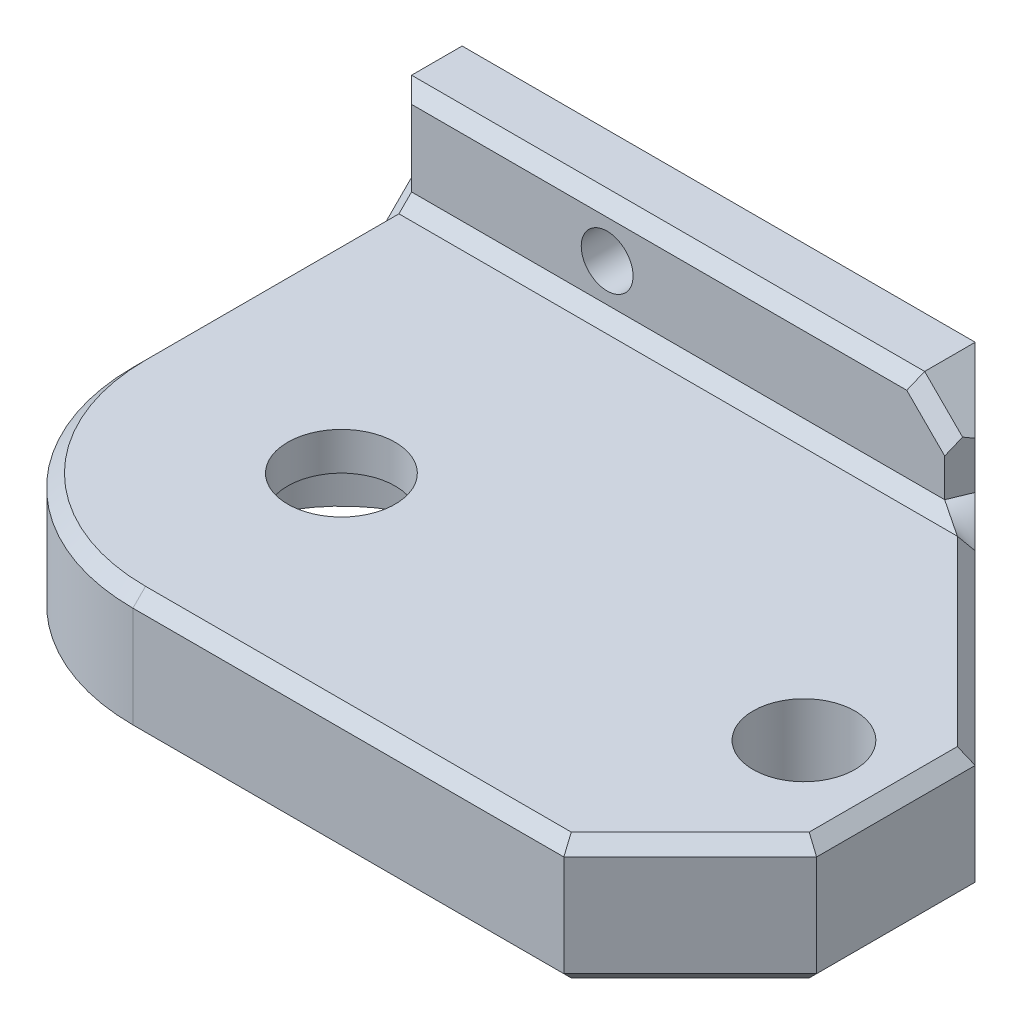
ISO-10303-21;
HEADER;
FILE_DESCRIPTION(('STEP AP214'),'2;1');
FILE_NAME('part.step','',(''),(''),'','','');
FILE_SCHEMA(('AUTOMOTIVE_DESIGN { 1 0 10303 214 1 1 1 1 }'));
ENDSEC;
DATA;
#1=APPLICATION_CONTEXT('core data for automotive mechanical design processes');
#2=APPLICATION_PROTOCOL_DEFINITION('international standard','automotive_design',2000,#1);
#3=PRODUCT_CONTEXT('',#1,'mechanical');
#4=PRODUCT('Part','Part','',(#3));
#5=PRODUCT_RELATED_PRODUCT_CATEGORY('part','',(#4));
#6=PRODUCT_DEFINITION_FORMATION('','',#4);
#7=PRODUCT_DEFINITION_CONTEXT('part definition',#1,'design');
#8=PRODUCT_DEFINITION('design','',#6,#7);
#9=PRODUCT_DEFINITION_SHAPE('','',#8);
#10=(LENGTH_UNIT() NAMED_UNIT(*) SI_UNIT(.MILLI.,.METRE.));
#11=(NAMED_UNIT(*) PLANE_ANGLE_UNIT() SI_UNIT($,.RADIAN.));
#12=(NAMED_UNIT(*) SI_UNIT($,.STERADIAN.) SOLID_ANGLE_UNIT());
#13=UNCERTAINTY_MEASURE_WITH_UNIT(LENGTH_MEASURE(1.E-05),#10,'distance_accuracy_value','');
#14=(GEOMETRIC_REPRESENTATION_CONTEXT(3) GLOBAL_UNCERTAINTY_ASSIGNED_CONTEXT((#13)) GLOBAL_UNIT_ASSIGNED_CONTEXT((#10,
#11,#12)) REPRESENTATION_CONTEXT('',''));
#15=CARTESIAN_POINT('',(0.,0.,0.));
#16=DIRECTION('',(0.,0.,1.));
#17=DIRECTION('',(1.,0.,0.));
#18=AXIS2_PLACEMENT_3D('',#15,#16,#17);
#19=CARTESIAN_POINT('',(-19.2042355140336,25.1618753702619,1021.10000000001));
#20=DIRECTION('',(1.,0.,0.));
#21=DIRECTION('',(0.,1.,0.));
#22=AXIS2_PLACEMENT_3D('',#19,#20,#21);
#23=PLANE('',#22);
#24=DIRECTION('',(0.,-0.707106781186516,-0.707106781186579));
#25=VECTOR('',#24,1.);
#26=CARTESIAN_POINT('',(-19.2042355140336,14.1618753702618,999.050000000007));
#27=LINE('',#26,#25);
#28=CARTESIAN_POINT('',(-19.2042355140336,16.1618753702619,1001.05000000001));
#29=VERTEX_POINT('',#28);
#30=CARTESIAN_POINT('',(-19.2042355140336,15.1618753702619,1000.05000000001));
#31=VERTEX_POINT('',#30);
#32=EDGE_CURVE('E764',#29,#31,#27,.T.);
#33=ORIENTED_EDGE('',*,*,#32,.F.);
#34=DIRECTION('',(0.,0.,1.));
#35=VECTOR('',#34,1.);
#36=CARTESIAN_POINT('',(-19.2042355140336,16.1618753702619,1021.10000000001));
#37=LINE('',#36,#35);
#38=CARTESIAN_POINT('',(-19.2042355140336,16.1618753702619,1021.10000000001));
#39=VERTEX_POINT('',#38);
#40=EDGE_CURVE('E775',#29,#39,#37,.T.);
#41=ORIENTED_EDGE('',*,*,#40,.T.);
#42=DIRECTION('',(0.,-1.,0.));
#43=VECTOR('',#42,1.);
#44=CARTESIAN_POINT('',(-19.2042355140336,25.1618753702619,1021.10000000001));
#45=LINE('',#44,#43);
#46=CARTESIAN_POINT('',(-19.2042355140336,24.1618753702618,1021.10000000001));
#47=VERTEX_POINT('',#46);
#48=EDGE_CURVE('E248',#47,#39,#45,.T.);
#49=ORIENTED_EDGE('',*,*,#48,.F.);
#50=DIRECTION('',(0.,0.,-1.));
#51=VECTOR('',#50,1.);
#52=CARTESIAN_POINT('',(-19.2042355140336,24.1618753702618,1000.05000000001));
#53=LINE('',#52,#51);
#54=CARTESIAN_POINT('',(-19.2042355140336,24.1618753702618,1001.05000000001));
#55=VERTEX_POINT('',#54);
#56=EDGE_CURVE('E760',#47,#55,#53,.T.);
#57=ORIENTED_EDGE('',*,*,#56,.T.);
#58=DIRECTION('',(0.,-0.707106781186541,0.707106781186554));
#59=VECTOR('',#58,1.);
#60=CARTESIAN_POINT('',(-19.2042355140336,24.1618753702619,1001.05000000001));
#61=LINE('',#60,#59);
#62=CARTESIAN_POINT('',(-19.2042355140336,25.1618753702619,1000.05000000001));
#63=VERTEX_POINT('',#62);
#64=EDGE_CURVE('E751',#63,#55,#61,.T.);
#65=ORIENTED_EDGE('',*,*,#64,.F.);
#66=DIRECTION('',(0.,-0.707106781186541,0.707106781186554));
#67=VECTOR('',#66,1.);
#68=CARTESIAN_POINT('',(-19.2042355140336,24.1618753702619,1001.05000000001));
#69=LINE('',#68,#67);
#70=CARTESIAN_POINT('',(-19.2042355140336,26.161875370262,999.050000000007));
#71=VERTEX_POINT('',#70);
#72=EDGE_CURVE('E749',#71,#63,#69,.T.);
#73=ORIENTED_EDGE('',*,*,#72,.F.);
#74=DIRECTION('',(0.,1.,0.));
#75=VECTOR('',#74,1.);
#76=CARTESIAN_POINT('',(-19.2042355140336,33.1618753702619,999.050000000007));
#77=LINE('',#76,#75);
#78=CARTESIAN_POINT('',(-19.2042355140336,33.1618753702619,999.050000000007));
#79=VERTEX_POINT('',#78);
#80=EDGE_CURVE('E257',#71,#79,#77,.T.);
#81=ORIENTED_EDGE('',*,*,#80,.T.);
#82=DIRECTION('',(0.,0.,1.));
#83=VECTOR('',#82,1.);
#84=CARTESIAN_POINT('',(-19.2042355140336,33.1618753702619,995.050000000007));
#85=LINE('',#84,#83);
#86=CARTESIAN_POINT('',(-19.2042355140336,33.1618753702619,995.050000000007));
#87=VERTEX_POINT('',#86);
#88=EDGE_CURVE('E251',#87,#79,#85,.T.);
#89=ORIENTED_EDGE('',*,*,#88,.F.);
#90=DIRECTION('',(0.,-1.,0.));
#91=VECTOR('',#90,1.);
#92=CARTESIAN_POINT('',(-19.2042355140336,25.1618753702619,995.050000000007));
#93=LINE('',#92,#91);
#94=CARTESIAN_POINT('',(-19.2042355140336,7.1618753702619,995.050000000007));
#95=VERTEX_POINT('',#94);
#96=EDGE_CURVE('E240',#87,#95,#93,.T.);
#97=ORIENTED_EDGE('',*,*,#96,.T.);
#98=DIRECTION('',(0.,0.,1.));
#99=VECTOR('',#98,1.);
#100=CARTESIAN_POINT('',(-19.2042355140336,7.1618753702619,995.050000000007));
#101=LINE('',#100,#99);
#102=CARTESIAN_POINT('',(-19.2042355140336,7.1618753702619,999.050000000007));
#103=VERTEX_POINT('',#102);
#104=EDGE_CURVE('E269',#95,#103,#101,.T.);
#105=ORIENTED_EDGE('',*,*,#104,.T.);
#106=DIRECTION('',(0.,1.,0.));
#107=VECTOR('',#106,1.);
#108=CARTESIAN_POINT('',(-19.2042355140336,15.1618753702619,999.050000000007));
#109=LINE('',#108,#107);
#110=CARTESIAN_POINT('',(-19.2042355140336,14.1618753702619,999.050000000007));
#111=VERTEX_POINT('',#110);
#112=EDGE_CURVE('E768',#103,#111,#109,.T.);
#113=ORIENTED_EDGE('',*,*,#112,.T.);
#114=DIRECTION('',(0.,-0.707106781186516,-0.707106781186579));
#115=VECTOR('',#114,1.);
#116=CARTESIAN_POINT('',(-19.2042355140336,14.1618753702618,999.050000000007));
#117=LINE('',#116,#115);
#118=EDGE_CURVE('E761',#31,#111,#117,.T.);
#119=ORIENTED_EDGE('',*,*,#118,.F.);
#120=EDGE_LOOP('',(#33,#41,#49,#57,#65,#73,#81,#89,#97,#105,#113,#119));
#121=FACE_BOUND('',#120,.T.);
#122=ADVANCED_FACE('F50',(#121),#23,.F.);
#123=CARTESIAN_POINT('',(-2.70423551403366,25.1618753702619,1021.10000000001));
#124=DIRECTION('',(0.,-1.,0.));
#125=DIRECTION('',(1.,0.,0.));
#126=AXIS2_PLACEMENT_3D('',#123,#124,#125);
#127=CYLINDRICAL_SURFACE('',#126,10.95);
#128=CARTESIAN_POINT('',(-2.70423551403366,15.1618753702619,1021.10000000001));
#129=DIRECTION('',(0.,1.,0.));
#130=DIRECTION('',(-1.,0.,0.));
#131=AXIS2_PLACEMENT_3D('',#128,#129,#130);
#132=CIRCLE('',#131,10.95);
#133=CARTESIAN_POINT('',(-13.6542355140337,15.1618753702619,1021.10000000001));
#134=VERTEX_POINT('',#133);
#135=EDGE_CURVE('E284',#134,#134,#132,.T.);
#136=ORIENTED_EDGE('',*,*,#135,.F.);
#137=EDGE_LOOP('',(#136));
#138=FACE_BOUND('',#137,.T.);
#139=CARTESIAN_POINT('',(-2.70423551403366,22.1618753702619,1021.10000000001));
#140=DIRECTION('',(0.,1.,0.));
#141=DIRECTION('',(-1.,0.,0.));
#142=AXIS2_PLACEMENT_3D('',#139,#140,#141);
#143=CIRCLE('',#142,10.95);
#144=CARTESIAN_POINT('',(-13.6542355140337,22.1618753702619,1021.10000000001));
#145=VERTEX_POINT('',#144);
#146=EDGE_CURVE('E279',#145,#145,#143,.T.);
#147=ORIENTED_EDGE('',*,*,#146,.T.);
#148=EDGE_LOOP('',(#147));
#149=FACE_BOUND('',#148,.T.);
#150=ADVANCED_FACE('F874',(#138,#149),#127,.F.);
#151=CARTESIAN_POINT('',(-2.70423551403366,25.1618753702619,1021.10000000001));
#152=DIRECTION('',(0.,1.,0.));
#153=DIRECTION('',(-1.,0.,0.));
#154=AXIS2_PLACEMENT_3D('',#151,#152,#153);
#155=PLANE('',#154);
#156=DIRECTION('',(-1.,0.,0.));
#157=VECTOR('',#156,1.);
#158=CARTESIAN_POINT('',(-19.2042355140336,25.1618753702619,1001.05000000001));
#159=LINE('',#158,#157);
#160=CARTESIAN_POINT('',(25.9815509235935,25.1618753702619,1001.05000000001));
#161=VERTEX_POINT('',#160);
#162=CARTESIAN_POINT('',(-18.2042355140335,25.1618753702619,1001.05000000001));
#163=VERTEX_POINT('',#162);
#164=EDGE_CURVE('E631',#161,#163,#159,.T.);
#165=ORIENTED_EDGE('',*,*,#164,.T.);
#166=DIRECTION('',(0.,0.,1.));
#167=VECTOR('',#166,1.);
#168=CARTESIAN_POINT('',(-18.2042355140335,25.1618753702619,1021.10000000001));
#169=LINE('',#168,#167);
#170=CARTESIAN_POINT('',(-18.2042355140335,25.1618753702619,1021.10000000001));
#171=VERTEX_POINT('',#170);
#172=EDGE_CURVE('E640',#163,#171,#169,.T.);
#173=ORIENTED_EDGE('',*,*,#172,.T.);
#174=CARTESIAN_POINT('',(-2.70423551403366,25.1618753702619,1021.10000000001));
#175=DIRECTION('',(0.,1.,0.));
#176=DIRECTION('',(-1.,0.,0.));
#177=AXIS2_PLACEMENT_3D('',#174,#175,#176);
#178=CIRCLE('',#177,15.4999999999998);
#179=CARTESIAN_POINT('',(-2.70423551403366,25.1618753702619,1036.60000000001));
#180=VERTEX_POINT('',#179);
#181=EDGE_CURVE('E632',#171,#180,#178,.T.);
#182=ORIENTED_EDGE('',*,*,#181,.T.);
#183=DIRECTION('',(1.,0.,0.));
#184=VECTOR('',#183,1.);
#185=CARTESIAN_POINT('',(31.3957644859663,25.1618753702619,1036.60000000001));
#186=LINE('',#185,#184);
#187=CARTESIAN_POINT('',(30.9815509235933,25.1618753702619,1036.60000000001));
#188=VERTEX_POINT('',#187);
#189=EDGE_CURVE('E606',#180,#188,#186,.T.);
#190=ORIENTED_EDGE('',*,*,#189,.T.);
#191=DIRECTION('',(0.707106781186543,0.,-0.707106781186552));
#192=VECTOR('',#191,1.);
#193=CARTESIAN_POINT('',(21.8886577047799,25.1618753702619,1045.69289321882));
#194=LINE('',#193,#192);
#195=CARTESIAN_POINT('',(40.3957644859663,25.1618753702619,1027.18578643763));
#196=VERTEX_POINT('',#195);
#197=EDGE_CURVE('E614',#188,#196,#194,.T.);
#198=ORIENTED_EDGE('',*,*,#197,.T.);
#199=DIRECTION('',(0.,0.,-1.));
#200=VECTOR('',#199,1.);
#201=CARTESIAN_POINT('',(40.3957644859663,25.1618753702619,1015.05000000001));
#202=LINE('',#201,#200);
#203=CARTESIAN_POINT('',(40.3957644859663,25.1618753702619,1015.46421356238));
#204=VERTEX_POINT('',#203);
#205=EDGE_CURVE('E620',#196,#204,#202,.T.);
#206=ORIENTED_EDGE('',*,*,#205,.T.);
#207=DIRECTION('',(-0.707106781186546,0.,-0.707106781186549));
#208=VECTOR('',#207,1.);
#209=CARTESIAN_POINT('',(21.6636577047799,25.1618753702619,996.732106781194));
#210=LINE('',#209,#208);
#211=EDGE_CURVE('E621',#204,#161,#210,.T.);
#212=ORIENTED_EDGE('',*,*,#211,.T.);
#213=EDGE_LOOP('',(#165,#173,#182,#190,#198,#206,#212));
#214=FACE_BOUND('',#213,.T.);
#215=CARTESIAN_POINT('',(-2.70423551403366,25.1618753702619,1021.10000000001));
#216=DIRECTION('',(0.,1.,0.));
#217=DIRECTION('',(-1.,0.,0.));
#218=AXIS2_PLACEMENT_3D('',#215,#216,#217);
#219=CIRCLE('',#218,4.25000000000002);
#220=CARTESIAN_POINT('',(-6.95423551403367,25.1618753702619,1021.10000000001));
#221=VERTEX_POINT('',#220);
#222=EDGE_CURVE('E585',#221,#221,#219,.T.);
#223=ORIENTED_EDGE('',*,*,#222,.F.);
#224=EDGE_LOOP('',(#223));
#225=FACE_BOUND('',#224,.T.);
#226=CARTESIAN_POINT('',(33.8957644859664,25.1618753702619,1021.10000000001));
#227=DIRECTION('',(0.,1.,0.));
#228=DIRECTION('',(-1.,0.,0.));
#229=AXIS2_PLACEMENT_3D('',#226,#227,#228);
#230=CIRCLE('',#229,4.02499999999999);
#231=CARTESIAN_POINT('',(29.8707644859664,25.1618753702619,1021.10000000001));
#232=VERTEX_POINT('',#231);
#233=EDGE_CURVE('E283',#232,#232,#230,.T.);
#234=ORIENTED_EDGE('',*,*,#233,.F.);
#235=EDGE_LOOP('',(#234));
#236=FACE_BOUND('',#235,.T.);
#237=ADVANCED_FACE('F684',(#214,#225,#236),#155,.T.);
#238=CARTESIAN_POINT('',(-2.70423551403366,15.1618753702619,1021.10000000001));
#239=DIRECTION('',(0.,1.,0.));
#240=DIRECTION('',(-1.,0.,0.));
#241=AXIS2_PLACEMENT_3D('',#238,#239,#240);
#242=PLANE('',#241);
#243=DIRECTION('',(-0.707106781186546,0.,-0.707106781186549));
#244=VECTOR('',#243,1.);
#245=CARTESIAN_POINT('',(21.3957644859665,15.1618753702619,995.050000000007));
#246=LINE('',#245,#244);
#247=CARTESIAN_POINT('',(22.3957644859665,15.1618753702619,996.050000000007));
#248=VERTEX_POINT('',#247);
#249=CARTESIAN_POINT('',(40.3957644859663,15.1618753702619,1014.05000000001));
#250=VERTEX_POINT('',#249);
#251=EDGE_CURVE('E308',#248,#250,#246,.F.);
#252=ORIENTED_EDGE('',*,*,#251,.T.);
#253=DIRECTION('',(0.,0.,1.));
#254=VECTOR('',#253,1.);
#255=CARTESIAN_POINT('',(40.3957644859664,15.1618753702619,1021.10000000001));
#256=LINE('',#255,#254);
#257=CARTESIAN_POINT('',(40.3957644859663,15.1618753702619,1027.18578643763));
#258=VERTEX_POINT('',#257);
#259=EDGE_CURVE('E697',#250,#258,#256,.T.);
#260=ORIENTED_EDGE('',*,*,#259,.T.);
#261=DIRECTION('',(-0.707106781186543,0.,0.707106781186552));
#262=VECTOR('',#261,1.);
#263=CARTESIAN_POINT('',(30.6886577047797,15.1618753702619,1036.89289321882));
#264=LINE('',#263,#262);
#265=CARTESIAN_POINT('',(30.9815509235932,15.1618753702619,1036.60000000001));
#266=VERTEX_POINT('',#265);
#267=EDGE_CURVE('E730',#258,#266,#264,.T.);
#268=ORIENTED_EDGE('',*,*,#267,.T.);
#269=DIRECTION('',(-1.,0.,0.));
#270=VECTOR('',#269,1.);
#271=CARTESIAN_POINT('',(-2.70423551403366,15.1618753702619,1036.60000000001));
#272=LINE('',#271,#270);
#273=CARTESIAN_POINT('',(-2.70423551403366,15.1618753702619,1036.60000000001));
#274=VERTEX_POINT('',#273);
#275=EDGE_CURVE('E722',#266,#274,#272,.T.);
#276=ORIENTED_EDGE('',*,*,#275,.T.);
#277=CARTESIAN_POINT('',(-2.70423551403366,15.1618753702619,1021.10000000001));
#278=DIRECTION('',(0.,1.,0.));
#279=DIRECTION('',(-1.,0.,0.));
#280=AXIS2_PLACEMENT_3D('',#277,#278,#279);
#281=CIRCLE('',#280,15.4999999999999);
#282=CARTESIAN_POINT('',(-18.2042355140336,15.1618753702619,1021.10000000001));
#283=VERTEX_POINT('',#282);
#284=EDGE_CURVE('E721',#274,#283,#281,.F.);
#285=ORIENTED_EDGE('',*,*,#284,.T.);
#286=DIRECTION('',(0.,0.,-1.));
#287=VECTOR('',#286,1.);
#288=CARTESIAN_POINT('',(-18.2042355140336,15.1618753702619,1021.10000000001));
#289=LINE('',#288,#287);
#290=CARTESIAN_POINT('',(-18.2042355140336,15.1618753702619,1001.05000000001));
#291=VERTEX_POINT('',#290);
#292=EDGE_CURVE('E716',#283,#291,#289,.T.);
#293=ORIENTED_EDGE('',*,*,#292,.T.);
#294=DIRECTION('',(1.,0.,0.));
#295=VECTOR('',#294,1.);
#296=CARTESIAN_POINT('',(-2.70423551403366,15.1618753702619,1001.05000000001));
#297=LINE('',#296,#295);
#298=CARTESIAN_POINT('',(20.3957644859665,15.1618753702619,1001.05000000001));
#299=VERTEX_POINT('',#298);
#300=EDGE_CURVE('E711',#291,#299,#297,.T.);
#301=ORIENTED_EDGE('',*,*,#300,.T.);
#302=DIRECTION('',(-0.707106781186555,0.,0.70710678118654));
#303=VECTOR('',#302,1.);
#304=CARTESIAN_POINT('',(20.3957644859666,15.1618753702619,1001.05000000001));
#305=LINE('',#304,#303);
#306=CARTESIAN_POINT('',(21.3957644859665,15.1618753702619,1000.05000000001));
#307=VERTEX_POINT('',#306);
#308=EDGE_CURVE('E705',#307,#299,#305,.T.);
#309=ORIENTED_EDGE('',*,*,#308,.F.);
#310=DIRECTION('',(-0.707106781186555,0.,0.70710678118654));
#311=VECTOR('',#310,1.);
#312=CARTESIAN_POINT('',(20.3957644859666,15.1618753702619,1001.05000000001));
#313=LINE('',#312,#311);
#314=CARTESIAN_POINT('',(22.3957644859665,15.1618753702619,999.050000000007));
#315=VERTEX_POINT('',#314);
#316=EDGE_CURVE('E707',#315,#307,#313,.T.);
#317=ORIENTED_EDGE('',*,*,#316,.F.);
#318=DIRECTION('',(0.,0.,-1.));
#319=VECTOR('',#318,1.);
#320=CARTESIAN_POINT('',(22.3957644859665,15.1618753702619,1021.10000000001));
#321=LINE('',#320,#319);
#322=EDGE_CURVE('E712',#315,#248,#321,.T.);
#323=ORIENTED_EDGE('',*,*,#322,.T.);
#324=EDGE_LOOP('',(#252,#260,#268,#276,#285,#293,#301,#309,#317,#323));
#325=FACE_BOUND('',#324,.T.);
#326=ORIENTED_EDGE('',*,*,#135,.T.);
#327=EDGE_LOOP('',(#326));
#328=FACE_BOUND('',#327,.T.);
#329=CARTESIAN_POINT('',(33.8957644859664,15.1618753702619,1021.10000000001));
#330=DIRECTION('',(0.,1.,0.));
#331=DIRECTION('',(-1.,0.,0.));
#332=AXIS2_PLACEMENT_3D('',#329,#330,#331);
#333=CIRCLE('',#332,4.02499999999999);
#334=CARTESIAN_POINT('',(29.8707644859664,15.1618753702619,1021.10000000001));
#335=VERTEX_POINT('',#334);
#336=EDGE_CURVE('E277',#335,#335,#333,.T.);
#337=ORIENTED_EDGE('',*,*,#336,.T.);
#338=EDGE_LOOP('',(#337));
#339=FACE_BOUND('',#338,.T.);
#340=ADVANCED_FACE('F830',(#325,#328,#339),#242,.F.);
#341=CARTESIAN_POINT('',(-2.70423551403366,25.1618753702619,1021.10000000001));
#342=DIRECTION('',(0.,-1.,0.));
#343=DIRECTION('',(1.,0.,0.));
#344=AXIS2_PLACEMENT_3D('',#341,#342,#343);
#345=CYLINDRICAL_SURFACE('',#344,16.5);
#346=ORIENTED_EDGE('',*,*,#48,.T.);
#347=CARTESIAN_POINT('',(-2.70423551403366,16.1618753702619,1021.10000000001));
#348=DIRECTION('',(0.,1.,0.));
#349=DIRECTION('',(-1.,0.,0.));
#350=AXIS2_PLACEMENT_3D('',#347,#348,#349);
#351=CIRCLE('',#350,16.5);
#352=CARTESIAN_POINT('',(-2.70423551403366,16.1618753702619,1037.60000000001));
#353=VERTEX_POINT('',#352);
#354=EDGE_CURVE('E744',#39,#353,#351,.T.);
#355=ORIENTED_EDGE('',*,*,#354,.T.);
#356=DIRECTION('',(0.,-1.,0.));
#357=VECTOR('',#356,1.);
#358=CARTESIAN_POINT('',(-2.70423551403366,25.1618753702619,1037.60000000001));
#359=LINE('',#358,#357);
#360=CARTESIAN_POINT('',(-2.70423551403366,24.1618753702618,1037.60000000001));
#361=VERTEX_POINT('',#360);
#362=EDGE_CURVE('E247',#361,#353,#359,.T.);
#363=ORIENTED_EDGE('',*,*,#362,.F.);
#364=CARTESIAN_POINT('',(-2.70423551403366,24.1618753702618,1021.10000000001));
#365=DIRECTION('',(0.,1.,0.));
#366=DIRECTION('',(0.,0.,1.));
#367=AXIS2_PLACEMENT_3D('',#364,#365,#366);
#368=CIRCLE('',#367,16.5);
#369=EDGE_CURVE('E745',#361,#47,#368,.F.);
#370=ORIENTED_EDGE('',*,*,#369,.T.);
#371=EDGE_LOOP('',(#346,#355,#363,#370));
#372=FACE_BOUND('',#371,.T.);
#373=ADVANCED_FACE('F818',(#372),#345,.T.);
#374=CARTESIAN_POINT('',(-2.70423551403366,25.1618753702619,1037.60000000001));
#375=DIRECTION('',(0.,0.,-1.));
#376=DIRECTION('',(0.,1.,0.));
#377=AXIS2_PLACEMENT_3D('',#374,#375,#376);
#378=PLANE('',#377);
#379=ORIENTED_EDGE('',*,*,#362,.T.);
#380=DIRECTION('',(1.,0.,0.));
#381=VECTOR('',#380,1.);
#382=CARTESIAN_POINT('',(-2.70423551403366,16.1618753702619,1037.60000000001));
#383=LINE('',#382,#381);
#384=CARTESIAN_POINT('',(31.3957644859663,16.1618753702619,1037.60000000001));
#385=VERTEX_POINT('',#384);
#386=EDGE_CURVE('E737',#353,#385,#383,.T.);
#387=ORIENTED_EDGE('',*,*,#386,.T.);
#388=DIRECTION('',(0.,1.,0.));
#389=VECTOR('',#388,1.);
#390=CARTESIAN_POINT('',(31.3957644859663,25.1618753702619,1037.60000000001));
#391=LINE('',#390,#389);
#392=CARTESIAN_POINT('',(31.3957644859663,24.1618753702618,1037.60000000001));
#393=VERTEX_POINT('',#392);
#394=EDGE_CURVE('E305',#385,#393,#391,.T.);
#395=ORIENTED_EDGE('',*,*,#394,.T.);
#396=DIRECTION('',(-1.,0.,0.));
#397=VECTOR('',#396,1.);
#398=CARTESIAN_POINT('',(-2.70423551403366,24.1618753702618,1037.60000000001));
#399=LINE('',#398,#397);
#400=EDGE_CURVE('E607',#393,#361,#399,.T.);
#401=ORIENTED_EDGE('',*,*,#400,.T.);
#402=EDGE_LOOP('',(#379,#387,#395,#401));
#403=FACE_BOUND('',#402,.T.);
#404=ADVANCED_FACE('F816',(#403),#378,.F.);
#405=CARTESIAN_POINT('',(41.3957644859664,25.1618753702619,995.050000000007));
#406=DIRECTION('',(-1.,0.,0.));
#407=DIRECTION('',(0.,0.,1.));
#408=AXIS2_PLACEMENT_3D('',#405,#406,#407);
#409=PLANE('',#408);
#410=DIRECTION('',(0.,-1.,0.));
#411=VECTOR('',#410,1.);
#412=CARTESIAN_POINT('',(41.3957644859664,25.1618753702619,1027.60000000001));
#413=LINE('',#412,#411);
#414=CARTESIAN_POINT('',(41.3957644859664,24.1618753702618,1027.60000000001));
#415=VERTEX_POINT('',#414);
#416=CARTESIAN_POINT('',(41.3957644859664,16.1618753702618,1027.60000000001));
#417=VERTEX_POINT('',#416);
#418=EDGE_CURVE('E296',#415,#417,#413,.T.);
#419=ORIENTED_EDGE('',*,*,#418,.T.);
#420=DIRECTION('',(0.,0.,-1.));
#421=VECTOR('',#420,1.);
#422=CARTESIAN_POINT('',(41.3957644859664,16.1618753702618,995.050000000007));
#423=LINE('',#422,#421);
#424=CARTESIAN_POINT('',(41.3957644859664,16.1618753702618,1015.05000000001));
#425=VERTEX_POINT('',#424);
#426=EDGE_CURVE('E325',#417,#425,#423,.T.);
#427=ORIENTED_EDGE('',*,*,#426,.T.);
#428=DIRECTION('',(0.,1.,0.));
#429=VECTOR('',#428,1.);
#430=CARTESIAN_POINT('',(41.3957644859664,25.1618753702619,1015.05000000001));
#431=LINE('',#430,#429);
#432=CARTESIAN_POINT('',(41.3957644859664,24.1618753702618,1015.05000000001));
#433=VERTEX_POINT('',#432);
#434=EDGE_CURVE('E315',#425,#433,#431,.T.);
#435=ORIENTED_EDGE('',*,*,#434,.T.);
#436=DIRECTION('',(0.,0.,1.));
#437=VECTOR('',#436,1.);
#438=CARTESIAN_POINT('',(41.3957644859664,24.1618753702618,1027.60000000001));
#439=LINE('',#438,#437);
#440=EDGE_CURVE('E318',#433,#415,#439,.T.);
#441=ORIENTED_EDGE('',*,*,#440,.T.);
#442=EDGE_LOOP('',(#419,#427,#435,#441));
#443=FACE_BOUND('',#442,.T.);
#444=ADVANCED_FACE('F696',(#443),#409,.F.);
#445=CARTESIAN_POINT('',(-19.2042355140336,25.1618753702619,995.050000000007));
#446=DIRECTION('',(0.,0.,1.));
#447=DIRECTION('',(0.,-1.,0.));
#448=AXIS2_PLACEMENT_3D('',#445,#446,#447);
#449=PLANE('',#448);
#450=CARTESIAN_POINT('',(-2.72923551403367,29.1618753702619,995.050000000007));
#451=DIRECTION('',(0.,0.,-1.));
#452=DIRECTION('',(0.,1.,0.));
#453=AXIS2_PLACEMENT_3D('',#450,#451,#452);
#454=CIRCLE('',#453,2.05);
#455=CARTESIAN_POINT('',(-2.72923551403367,31.2118753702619,995.050000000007));
#456=VERTEX_POINT('',#455);
#457=EDGE_CURVE('E669',#456,#456,#454,.T.);
#458=ORIENTED_EDGE('',*,*,#457,.F.);
#459=EDGE_LOOP('',(#458));
#460=FACE_BOUND('',#459,.T.);
#461=CARTESIAN_POINT('',(-2.72923551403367,11.1618753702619,995.050000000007));
#462=DIRECTION('',(0.,0.,-1.));
#463=DIRECTION('',(0.,1.,0.));
#464=AXIS2_PLACEMENT_3D('',#461,#462,#463);
#465=CIRCLE('',#464,2.05);
#466=CARTESIAN_POINT('',(-2.72923551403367,13.2118753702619,995.050000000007));
#467=VERTEX_POINT('',#466);
#468=EDGE_CURVE('E855',#467,#467,#465,.T.);
#469=ORIENTED_EDGE('',*,*,#468,.F.);
#470=EDGE_LOOP('',(#469));
#471=FACE_BOUND('',#470,.T.);
#472=ORIENTED_EDGE('',*,*,#96,.F.);
#473=DIRECTION('',(-1.,0.,0.));
#474=VECTOR('',#473,1.);
#475=CARTESIAN_POINT('',(21.3957644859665,33.1618753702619,995.050000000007));
#476=LINE('',#475,#474);
#477=CARTESIAN_POINT('',(21.3957644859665,33.161875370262,995.050000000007));
#478=VERTEX_POINT('',#477);
#479=EDGE_CURVE('E239',#478,#87,#476,.T.);
#480=ORIENTED_EDGE('',*,*,#479,.F.);
#481=DIRECTION('',(0.,-1.,0.));
#482=VECTOR('',#481,1.);
#483=CARTESIAN_POINT('',(21.3957644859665,25.1618753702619,995.050000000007));
#484=LINE('',#483,#482);
#485=CARTESIAN_POINT('',(21.3957644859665,14.1618753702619,995.050000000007));
#486=VERTEX_POINT('',#485);
#487=EDGE_CURVE('E68',#478,#486,#484,.T.);
#488=ORIENTED_EDGE('',*,*,#487,.T.);
#489=DIRECTION('',(0.,1.,0.));
#490=VECTOR('',#489,1.);
#491=CARTESIAN_POINT('',(21.3957644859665,7.16187537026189,995.050000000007));
#492=LINE('',#491,#490);
#493=CARTESIAN_POINT('',(21.3957644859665,7.16187537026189,995.050000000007));
#494=VERTEX_POINT('',#493);
#495=EDGE_CURVE('E271',#494,#486,#492,.T.);
#496=ORIENTED_EDGE('',*,*,#495,.F.);
#497=DIRECTION('',(-1.,0.,0.));
#498=VECTOR('',#497,1.);
#499=CARTESIAN_POINT('',(21.3957644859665,7.16187537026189,995.050000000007));
#500=LINE('',#499,#498);
#501=EDGE_CURVE('E245',#494,#95,#500,.T.);
#502=ORIENTED_EDGE('',*,*,#501,.T.);
#503=EDGE_LOOP('',(#472,#480,#488,#496,#502));
#504=FACE_BOUND('',#503,.T.);
#505=ADVANCED_FACE('F237',(#460,#471,#504),#449,.F.);
#506=CARTESIAN_POINT('',(33.8957644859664,25.1618753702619,1021.10000000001));
#507=DIRECTION('',(0.,-1.,0.));
#508=DIRECTION('',(1.,0.,0.));
#509=AXIS2_PLACEMENT_3D('',#506,#507,#508);
#510=CYLINDRICAL_SURFACE('',#509,4.02499999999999);
#511=ORIENTED_EDGE('',*,*,#233,.T.);
#512=EDGE_LOOP('',(#511));
#513=FACE_BOUND('',#512,.T.);
#514=ORIENTED_EDGE('',*,*,#336,.F.);
#515=EDGE_LOOP('',(#514));
#516=FACE_BOUND('',#515,.T.);
#517=ADVANCED_FACE('F880',(#513,#516),#510,.F.);
#518=CARTESIAN_POINT('',(-2.70423551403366,22.1618753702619,1021.10000000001));
#519=DIRECTION('',(0.,1.,0.));
#520=DIRECTION('',(-1.,0.,0.));
#521=AXIS2_PLACEMENT_3D('',#518,#519,#520);
#522=PLANE('',#521);
#523=CARTESIAN_POINT('',(-2.70423551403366,22.1618753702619,1021.10000000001));
#524=DIRECTION('',(0.,1.,0.));
#525=DIRECTION('',(-1.,0.,0.));
#526=AXIS2_PLACEMENT_3D('',#523,#524,#525);
#527=CIRCLE('',#526,4.25000000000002);
#528=CARTESIAN_POINT('',(-6.95423551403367,22.1618753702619,1021.10000000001));
#529=VERTEX_POINT('',#528);
#530=EDGE_CURVE('E859',#529,#529,#527,.F.);
#531=ORIENTED_EDGE('',*,*,#530,.F.);
#532=EDGE_LOOP('',(#531));
#533=FACE_BOUND('',#532,.T.);
#534=ORIENTED_EDGE('',*,*,#146,.F.);
#535=EDGE_LOOP('',(#534));
#536=FACE_BOUND('',#535,.T.);
#537=ADVANCED_FACE('F885',(#533,#536),#522,.F.);
#538=CARTESIAN_POINT('',(41.3957644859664,25.1618753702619,1027.60000000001));
#539=DIRECTION('',(-0.707106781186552,0.,-0.707106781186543));
#540=DIRECTION('',(0.,-1.,0.));
#541=AXIS2_PLACEMENT_3D('',#538,#539,#540);
#542=PLANE('',#541);
#543=ORIENTED_EDGE('',*,*,#394,.F.);
#544=DIRECTION('',(-0.707106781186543,0.,0.707106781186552));
#545=VECTOR('',#544,1.);
#546=CARTESIAN_POINT('',(41.3957644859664,16.1618753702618,1027.60000000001));
#547=LINE('',#546,#545);
#548=EDGE_CURVE('E733',#385,#417,#547,.F.);
#549=ORIENTED_EDGE('',*,*,#548,.T.);
#550=ORIENTED_EDGE('',*,*,#418,.F.);
#551=DIRECTION('',(0.707106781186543,0.,-0.707106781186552));
#552=VECTOR('',#551,1.);
#553=CARTESIAN_POINT('',(41.3957644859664,24.1618753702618,1027.60000000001));
#554=LINE('',#553,#552);
#555=EDGE_CURVE('E612',#415,#393,#554,.F.);
#556=ORIENTED_EDGE('',*,*,#555,.T.);
#557=EDGE_LOOP('',(#543,#549,#550,#556));
#558=FACE_BOUND('',#557,.T.);
#559=ADVANCED_FACE('F825',(#558),#542,.F.);
#560=CARTESIAN_POINT('',(21.3957644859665,25.1618753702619,995.050000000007));
#561=DIRECTION('',(-0.707106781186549,0.,0.707106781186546));
#562=DIRECTION('',(0.,-1.,0.));
#563=AXIS2_PLACEMENT_3D('',#560,#561,#562);
#564=PLANE('',#563);
#565=ORIENTED_EDGE('',*,*,#434,.F.);
#566=DIRECTION('',(-0.577350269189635,-0.577350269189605,-0.577350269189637));
#567=VECTOR('',#566,1.);
#568=CARTESIAN_POINT('',(31.0624311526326,5.82854203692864,1004.71666666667));
#569=LINE('',#568,#567);
#570=EDGE_CURVE('E698',#425,#250,#569,.T.);
#571=ORIENTED_EDGE('',*,*,#570,.T.);
#572=ORIENTED_EDGE('',*,*,#251,.F.);
#573=DIRECTION('',(0.577350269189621,0.577350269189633,0.577350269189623));
#574=VECTOR('',#573,1.);
#575=CARTESIAN_POINT('',(30.7457644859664,23.511875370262,1004.40000000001));
#576=LINE('',#575,#574);
#577=EDGE_CURVE('E11',#248,#486,#576,.F.);
#578=ORIENTED_EDGE('',*,*,#577,.T.);
#579=ORIENTED_EDGE('',*,*,#487,.F.);
#580=DIRECTION('',(0.577350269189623,-0.577350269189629,0.577350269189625));
#581=VECTOR('',#580,1.);
#582=CARTESIAN_POINT('',(23.0624311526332,31.4952087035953,996.716666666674));
#583=LINE('',#582,#581);
#584=CARTESIAN_POINT('',(24.6886577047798,29.8689821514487,998.342893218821));
#585=VERTEX_POINT('',#584);
#586=EDGE_CURVE('E317',#478,#585,#583,.T.);
#587=ORIENTED_EDGE('',*,*,#586,.T.);
#588=DIRECTION('',(0.,1.,0.));
#589=VECTOR('',#588,1.);
#590=CARTESIAN_POINT('',(24.6886577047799,25.1618753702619,998.342893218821));
#591=LINE('',#590,#589);
#592=CARTESIAN_POINT('',(24.6886577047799,26.161875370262,998.342893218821));
#593=VERTEX_POINT('',#592);
#594=EDGE_CURVE('E338',#585,#593,#591,.F.);
#595=ORIENTED_EDGE('',*,*,#594,.T.);
#596=CARTESIAN_POINT('',(26.6886577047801,24.1618753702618,1000.34289321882));
#597=CARTESIAN_POINT('',(26.5108570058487,24.3396760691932,1000.16509251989));
#598=CARTESIAN_POINT('',(26.3330563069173,24.5174767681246,999.987291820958));
#599=CARTESIAN_POINT('',(25.9774549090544,24.8730781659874,999.631690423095));
#600=CARTESIAN_POINT('',(25.799654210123,25.0508788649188,999.453889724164));
#601=CARTESIAN_POINT('',(25.3107882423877,25.5397448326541,998.965023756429));
#602=CARTESIAN_POINT('',(24.9997229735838,25.8508101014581,998.653958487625));
#603=CARTESIAN_POINT('',(24.6886577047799,26.161875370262,998.342893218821));
#604=B_SPLINE_CURVE_WITH_KNOTS('',3,(#596,#597,#598,#599,#600,#601,#602,#603),.UNSPECIFIED.,.F.,
.F.,(4,2,2,4),(0.,0.92387953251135,1.8477590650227,3.46410161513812),.UNSPECIFIED.);
#605=CARTESIAN_POINT('',(26.6886577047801,24.1618753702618,1000.34289321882));
#606=VERTEX_POINT('',#605);
#607=EDGE_CURVE('E329',#606,#593,#604,.T.);
#608=ORIENTED_EDGE('',*,*,#607,.F.);
#609=DIRECTION('',(-0.707106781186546,0.,-0.707106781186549));
#610=VECTOR('',#609,1.);
#611=CARTESIAN_POINT('',(21.3957644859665,24.1618753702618,995.050000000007));
#612=LINE('',#611,#610);
#613=EDGE_CURVE('E330',#606,#433,#612,.F.);
#614=ORIENTED_EDGE('',*,*,#613,.T.);
#615=EDGE_LOOP('',(#565,#571,#572,#578,#579,#587,#595,#608,#614));
#616=FACE_BOUND('',#615,.T.);
#617=ADVANCED_FACE('F345',(#616),#564,.F.);
#618=CARTESIAN_POINT('',(0.,7.16187537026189,0.));
#619=DIRECTION('',(0.,1.,0.));
#620=DIRECTION('',(-1.,0.,0.));
#621=AXIS2_PLACEMENT_3D('',#618,#619,#620);
#622=PLANE('',#621);
#623=DIRECTION('',(0.,0.,-1.));
#624=VECTOR('',#623,1.);
#625=CARTESIAN_POINT('',(21.3957644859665,7.16187537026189,1000.05000000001));
#626=LINE('',#625,#624);
#627=CARTESIAN_POINT('',(21.3957644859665,7.16187537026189,999.050000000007));
#628=VERTEX_POINT('',#627);
#629=EDGE_CURVE('E265',#628,#494,#626,.T.);
#630=ORIENTED_EDGE('',*,*,#629,.F.);
#631=DIRECTION('',(-1.,0.,0.));
#632=VECTOR('',#631,1.);
#633=CARTESIAN_POINT('',(-19.2042355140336,7.1618753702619,999.050000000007));
#634=LINE('',#633,#632);
#635=EDGE_CURVE('E622',#628,#103,#634,.T.);
#636=ORIENTED_EDGE('',*,*,#635,.T.);
#637=ORIENTED_EDGE('',*,*,#104,.F.);
#638=ORIENTED_EDGE('',*,*,#501,.F.);
#639=EDGE_LOOP('',(#630,#636,#637,#638));
#640=FACE_BOUND('',#639,.T.);
#641=ADVANCED_FACE('F796',(#640),#622,.F.);
#642=CARTESIAN_POINT('',(-19.2042355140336,7.1618753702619,1000.05000000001));
#643=DIRECTION('',(0.,0.,1.));
#644=DIRECTION('',(0.,-1.,0.));
#645=AXIS2_PLACEMENT_3D('',#642,#643,#644);
#646=PLANE('',#645);
#647=DIRECTION('',(0.,1.,0.));
#648=VECTOR('',#647,1.);
#649=CARTESIAN_POINT('',(20.3957644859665,7.16187537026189,1000.05000000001));
#650=LINE('',#649,#648);
#651=CARTESIAN_POINT('',(20.3957644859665,8.16187537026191,1000.05000000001));
#652=VERTEX_POINT('',#651);
#653=CARTESIAN_POINT('',(20.3957644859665,14.1618753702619,1000.05000000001));
#654=VERTEX_POINT('',#653);
#655=EDGE_CURVE('E783',#652,#654,#650,.T.);
#656=ORIENTED_EDGE('',*,*,#655,.T.);
#657=DIRECTION('',(-1.,0.,0.));
#658=VECTOR('',#657,1.);
#659=CARTESIAN_POINT('',(-19.2042355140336,14.1618753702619,1000.05000000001));
#660=LINE('',#659,#658);
#661=CARTESIAN_POINT('',(-18.2042355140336,14.1618753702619,1000.05000000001));
#662=VERTEX_POINT('',#661);
#663=EDGE_CURVE('E789',#654,#662,#660,.T.);
#664=ORIENTED_EDGE('',*,*,#663,.T.);
#665=DIRECTION('',(0.,-1.,0.));
#666=VECTOR('',#665,1.);
#667=CARTESIAN_POINT('',(-18.2042355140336,7.1618753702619,1000.05000000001));
#668=LINE('',#667,#666);
#669=CARTESIAN_POINT('',(-18.2042355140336,8.16187537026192,1000.05000000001));
#670=VERTEX_POINT('',#669);
#671=EDGE_CURVE('E790',#662,#670,#668,.T.);
#672=ORIENTED_EDGE('',*,*,#671,.T.);
#673=DIRECTION('',(1.,0.,0.));
#674=VECTOR('',#673,1.);
#675=CARTESIAN_POINT('',(21.3957644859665,8.16187537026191,1000.05000000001));
#676=LINE('',#675,#674);
#677=EDGE_CURVE('E782',#670,#652,#676,.T.);
#678=ORIENTED_EDGE('',*,*,#677,.T.);
#679=EDGE_LOOP('',(#656,#664,#672,#678));
#680=FACE_BOUND('',#679,.T.);
#681=CARTESIAN_POINT('',(-2.72923551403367,11.1618753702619,1000.05000000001));
#682=DIRECTION('',(0.,0.,1.));
#683=DIRECTION('',(0.,-1.,0.));
#684=AXIS2_PLACEMENT_3D('',#681,#682,#683);
#685=CIRCLE('',#684,2.05);
#686=CARTESIAN_POINT('',(-2.72923551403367,9.11187537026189,1000.05000000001));
#687=VERTEX_POINT('',#686);
#688=EDGE_CURVE('E846',#687,#687,#685,.F.);
#689=ORIENTED_EDGE('',*,*,#688,.T.);
#690=EDGE_LOOP('',(#689));
#691=FACE_BOUND('',#690,.T.);
#692=ADVANCED_FACE('F838',(#680,#691),#646,.T.);
#693=CARTESIAN_POINT('',(21.3957644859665,7.16187537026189,1000.05000000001));
#694=DIRECTION('',(1.,0.,0.));
#695=DIRECTION('',(0.,1.,0.));
#696=AXIS2_PLACEMENT_3D('',#693,#694,#695);
#697=PLANE('',#696);
#698=ORIENTED_EDGE('',*,*,#495,.T.);
#699=DIRECTION('',(0.,0.,1.));
#700=VECTOR('',#699,1.);
#701=CARTESIAN_POINT('',(21.3957644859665,14.1618753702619,1000.05000000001));
#702=LINE('',#701,#700);
#703=CARTESIAN_POINT('',(21.3957644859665,14.1618753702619,999.050000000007));
#704=VERTEX_POINT('',#703);
#705=EDGE_CURVE('E780',#486,#704,#702,.T.);
#706=ORIENTED_EDGE('',*,*,#705,.T.);
#707=DIRECTION('',(0.,-1.,0.));
#708=VECTOR('',#707,1.);
#709=CARTESIAN_POINT('',(21.3957644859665,7.16187537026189,999.050000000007));
#710=LINE('',#709,#708);
#711=EDGE_CURVE('E773',#704,#628,#710,.T.);
#712=ORIENTED_EDGE('',*,*,#711,.T.);
#713=ORIENTED_EDGE('',*,*,#629,.T.);
#714=EDGE_LOOP('',(#698,#706,#712,#713));
#715=FACE_BOUND('',#714,.T.);
#716=ADVANCED_FACE('F834',(#715),#697,.T.);
#717=DIRECTION('',(1.,0.,0.));
#718=VECTOR('',#717,1.);
#719=CARTESIAN_POINT('',(26.3957644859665,26.161875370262,1000.05000000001));
#720=LINE('',#719,#718);
#721=CARTESIAN_POINT('',(-18.2042355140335,26.161875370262,1000.05000000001));
#722=VERTEX_POINT('',#721);
#723=CARTESIAN_POINT('',(23.9815509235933,26.161875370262,1000.05000000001));
#724=VERTEX_POINT('',#723);
#725=EDGE_CURVE('E642',#722,#724,#720,.T.);
#726=ORIENTED_EDGE('',*,*,#725,.T.);
#727=DIRECTION('',(0.,1.,0.));
#728=VECTOR('',#727,1.);
#729=CARTESIAN_POINT('',(23.9815509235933,7.16187537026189,1000.05000000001));
#730=LINE('',#729,#728);
#731=CARTESIAN_POINT('',(23.9815509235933,29.161875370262,1000.05000000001));
#732=VERTEX_POINT('',#731);
#733=EDGE_CURVE('E651',#724,#732,#730,.T.);
#734=ORIENTED_EDGE('',*,*,#733,.T.);
#735=DIRECTION('',(-0.707106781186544,0.707106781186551,0.));
#736=VECTOR('',#735,1.);
#737=CARTESIAN_POINT('',(20.68865770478,32.4547685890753,1000.05000000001));
#738=LINE('',#737,#736);
#739=CARTESIAN_POINT('',(20.9815509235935,32.1618753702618,1000.05000000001));
#740=VERTEX_POINT('',#739);
#741=EDGE_CURVE('E647',#732,#740,#738,.T.);
#742=ORIENTED_EDGE('',*,*,#741,.T.);
#743=DIRECTION('',(-1.,0.,0.));
#744=VECTOR('',#743,1.);
#745=CARTESIAN_POINT('',(-19.2042355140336,32.1618753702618,1000.05000000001));
#746=LINE('',#745,#744);
#747=CARTESIAN_POINT('',(-18.2042355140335,32.1618753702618,1000.05000000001));
#748=VERTEX_POINT('',#747);
#749=EDGE_CURVE('E646',#740,#748,#746,.T.);
#750=ORIENTED_EDGE('',*,*,#749,.T.);
#751=DIRECTION('',(0.,-1.,0.));
#752=VECTOR('',#751,1.);
#753=CARTESIAN_POINT('',(-18.2042355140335,25.1618753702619,1000.05000000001));
#754=LINE('',#753,#752);
#755=EDGE_CURVE('E641',#748,#722,#754,.T.);
#756=ORIENTED_EDGE('',*,*,#755,.T.);
#757=EDGE_LOOP('',(#726,#734,#742,#750,#756));
#758=FACE_BOUND('',#757,.T.);
#759=CARTESIAN_POINT('',(-2.72923551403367,29.1618753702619,1000.05000000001));
#760=DIRECTION('',(0.,0.,1.));
#761=DIRECTION('',(0.,-1.,0.));
#762=AXIS2_PLACEMENT_3D('',#759,#760,#761);
#763=CIRCLE('',#762,2.05);
#764=CARTESIAN_POINT('',(-2.72923551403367,27.1118753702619,1000.05000000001));
#765=VERTEX_POINT('',#764);
#766=EDGE_CURVE('E851',#765,#765,#763,.F.);
#767=ORIENTED_EDGE('',*,*,#766,.T.);
#768=EDGE_LOOP('',(#767));
#769=FACE_BOUND('',#768,.T.);
#770=ADVANCED_FACE('F671',(#758,#769),#646,.T.);
#771=CARTESIAN_POINT('',(0.,33.1618753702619,0.));
#772=DIRECTION('',(0.,1.,0.));
#773=DIRECTION('',(-1.,0.,0.));
#774=AXIS2_PLACEMENT_3D('',#771,#772,#773);
#775=PLANE('',#774);
#776=ORIENTED_EDGE('',*,*,#88,.T.);
#777=DIRECTION('',(1.,0.,0.));
#778=VECTOR('',#777,1.);
#779=CARTESIAN_POINT('',(0.,33.1618753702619,999.050000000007));
#780=LINE('',#779,#778);
#781=CARTESIAN_POINT('',(21.3957644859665,33.1618753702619,999.050000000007));
#782=VERTEX_POINT('',#781);
#783=EDGE_CURVE('E59',#79,#782,#780,.T.);
#784=ORIENTED_EDGE('',*,*,#783,.T.);
#785=DIRECTION('',(0.,0.,-1.));
#786=VECTOR('',#785,1.);
#787=CARTESIAN_POINT('',(21.3957644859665,33.1618753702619,1000.05000000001));
#788=LINE('',#787,#786);
#789=EDGE_CURVE('E259',#782,#478,#788,.T.);
#790=ORIENTED_EDGE('',*,*,#789,.T.);
#791=ORIENTED_EDGE('',*,*,#479,.T.);
#792=EDGE_LOOP('',(#776,#784,#790,#791));
#793=FACE_BOUND('',#792,.T.);
#794=ADVANCED_FACE('F254',(#793),#775,.T.);
#795=CARTESIAN_POINT('',(-2.72923551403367,29.1618753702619,1037.60100000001));
#796=DIRECTION('',(0.,0.,-1.));
#797=DIRECTION('',(0.,1.,0.));
#798=AXIS2_PLACEMENT_3D('',#795,#796,#797);
#799=CYLINDRICAL_SURFACE('',#798,2.05);
#800=ORIENTED_EDGE('',*,*,#766,.F.);
#801=EDGE_LOOP('',(#800));
#802=FACE_BOUND('',#801,.T.);
#803=ORIENTED_EDGE('',*,*,#457,.T.);
#804=EDGE_LOOP('',(#803));
#805=FACE_BOUND('',#804,.T.);
#806=ADVANCED_FACE('F927',(#802,#805),#799,.F.);
#807=CARTESIAN_POINT('',(-2.72923551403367,11.1618753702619,1037.60100000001));
#808=DIRECTION('',(0.,0.,-1.));
#809=DIRECTION('',(0.,1.,0.));
#810=AXIS2_PLACEMENT_3D('',#807,#808,#809);
#811=CYLINDRICAL_SURFACE('',#810,2.05);
#812=ORIENTED_EDGE('',*,*,#688,.F.);
#813=EDGE_LOOP('',(#812));
#814=FACE_BOUND('',#813,.T.);
#815=ORIENTED_EDGE('',*,*,#468,.T.);
#816=EDGE_LOOP('',(#815));
#817=FACE_BOUND('',#816,.T.);
#818=ADVANCED_FACE('F933',(#814,#817),#811,.F.);
#819=CARTESIAN_POINT('',(21.3957644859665,33.161875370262,1000.05000000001));
#820=DIRECTION('',(0.707106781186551,0.707106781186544,0.));
#821=DIRECTION('',(0.,0.,1.));
#822=AXIS2_PLACEMENT_3D('',#819,#820,#821);
#823=PLANE('',#822);
#824=DIRECTION('',(-0.707106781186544,0.707106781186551,0.));
#825=VECTOR('',#824,1.);
#826=CARTESIAN_POINT('',(26.3957644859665,28.161875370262,999.050000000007));
#827=LINE('',#826,#825);
#828=CARTESIAN_POINT('',(24.3957644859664,30.1618753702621,999.050000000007));
#829=VERTEX_POINT('',#828);
#830=EDGE_CURVE('E72',#782,#829,#827,.F.);
#831=ORIENTED_EDGE('',*,*,#830,.T.);
#832=DIRECTION('',(-0.357406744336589,0.357406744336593,0.862856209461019));
#833=VECTOR('',#832,1.);
#834=CARTESIAN_POINT('',(26.9724727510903,27.5851671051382,992.829275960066));
#835=LINE('',#834,#833);
#836=EDGE_CURVE('E657',#829,#585,#835,.F.);
#837=ORIENTED_EDGE('',*,*,#836,.T.);
#838=ORIENTED_EDGE('',*,*,#586,.F.);
#839=ORIENTED_EDGE('',*,*,#789,.F.);
#840=EDGE_LOOP('',(#831,#837,#838,#839));
#841=FACE_BOUND('',#840,.T.);
#842=ADVANCED_FACE('F358',(#841),#823,.T.);
#843=CARTESIAN_POINT('',(-2.70423551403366,7.16087537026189,1021.10000000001));
#844=DIRECTION('',(0.,1.,0.));
#845=DIRECTION('',(-1.,0.,0.));
#846=AXIS2_PLACEMENT_3D('',#843,#844,#845);
#847=CYLINDRICAL_SURFACE('',#846,4.25000000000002);
#848=ORIENTED_EDGE('',*,*,#222,.T.);
#849=EDGE_LOOP('',(#848));
#850=FACE_BOUND('',#849,.T.);
#851=ORIENTED_EDGE('',*,*,#530,.T.);
#852=EDGE_LOOP('',(#851));
#853=FACE_BOUND('',#852,.T.);
#854=ADVANCED_FACE('F443',(#850,#853),#847,.F.);
#855=CARTESIAN_POINT('',(22.3957644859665,15.1618753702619,1021.10000000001));
#856=DIRECTION('',(-0.707106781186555,0.70710678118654,0.));
#857=DIRECTION('',(0.,0.,-1.));
#858=AXIS2_PLACEMENT_3D('',#855,#856,#857);
#859=PLANE('',#858);
#860=ORIENTED_EDGE('',*,*,#577,.F.);
#861=ORIENTED_EDGE('',*,*,#322,.F.);
#862=DIRECTION('',(0.707106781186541,0.707106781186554,0.));
#863=VECTOR('',#862,1.);
#864=CARTESIAN_POINT('',(21.3957644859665,14.1618753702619,999.050000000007));
#865=LINE('',#864,#863);
#866=EDGE_CURVE('E576',#704,#315,#865,.T.);
#867=ORIENTED_EDGE('',*,*,#866,.F.);
#868=ORIENTED_EDGE('',*,*,#705,.F.);
#869=EDGE_LOOP('',(#860,#861,#867,#868));
#870=FACE_BOUND('',#869,.T.);
#871=ADVANCED_FACE('F438',(#870),#859,.F.);
#872=CARTESIAN_POINT('',(20.3957644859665,7.16187537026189,1000.05000000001));
#873=DIRECTION('',(-0.70710678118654,0.,-0.707106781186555));
#874=DIRECTION('',(0.,1.,0.));
#875=AXIS2_PLACEMENT_3D('',#872,#873,#874);
#876=PLANE('',#875);
#877=DIRECTION('',(-0.57735026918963,0.57735026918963,0.577350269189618));
#878=VECTOR('',#877,1.);
#879=CARTESIAN_POINT('',(20.7290978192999,7.82854203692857,999.716666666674));
#880=LINE('',#879,#878);
#881=EDGE_CURVE('E571',#628,#652,#880,.T.);
#882=ORIENTED_EDGE('',*,*,#881,.F.);
#883=ORIENTED_EDGE('',*,*,#711,.F.);
#884=DIRECTION('',(-0.707106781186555,0.,0.70710678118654));
#885=VECTOR('',#884,1.);
#886=CARTESIAN_POINT('',(20.3957644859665,14.1618753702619,1000.05000000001));
#887=LINE('',#886,#885);
#888=EDGE_CURVE('E574',#654,#704,#887,.F.);
#889=ORIENTED_EDGE('',*,*,#888,.F.);
#890=ORIENTED_EDGE('',*,*,#655,.F.);
#891=EDGE_LOOP('',(#882,#883,#889,#890));
#892=FACE_BOUND('',#891,.T.);
#893=ADVANCED_FACE('F435',(#892),#876,.F.);
#894=CARTESIAN_POINT('',(20.3957644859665,14.1618753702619,1000.05000000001));
#895=DIRECTION('',(-0.577350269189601,0.577350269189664,-0.577350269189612));
#896=DIRECTION('',(0.,0.707106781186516,0.707106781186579));
#897=AXIS2_PLACEMENT_3D('',#894,#895,#896);
#898=PLANE('',#897);
#899=ORIENTED_EDGE('',*,*,#316,.T.);
#900=ORIENTED_EDGE('',*,*,#308,.T.);
#901=DIRECTION('',(0.,-0.707106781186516,-0.707106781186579));
#902=VECTOR('',#901,1.);
#903=CARTESIAN_POINT('',(20.3957644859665,15.1618753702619,1001.05000000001));
#904=LINE('',#903,#902);
#905=EDGE_CURVE('E570',#654,#299,#904,.F.);
#906=ORIENTED_EDGE('',*,*,#905,.F.);
#907=ORIENTED_EDGE('',*,*,#888,.T.);
#908=ORIENTED_EDGE('',*,*,#866,.T.);
#909=EDGE_LOOP('',(#899,#900,#906,#907,#908));
#910=FACE_BOUND('',#909,.T.);
#911=ADVANCED_FACE('F424',(#910),#898,.F.);
#912=CARTESIAN_POINT('',(-19.2042355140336,8.16187537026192,1000.05000000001));
#913=DIRECTION('',(0.,-0.70710678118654,0.707106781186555));
#914=DIRECTION('',(-1.,0.,0.));
#915=AXIS2_PLACEMENT_3D('',#912,#913,#914);
#916=PLANE('',#915);
#917=ORIENTED_EDGE('',*,*,#881,.T.);
#918=ORIENTED_EDGE('',*,*,#677,.F.);
#919=DIRECTION('',(-0.577350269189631,-0.577350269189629,-0.577350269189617));
#920=VECTOR('',#919,1.);
#921=CARTESIAN_POINT('',(-18.5375688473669,7.82854203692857,999.716666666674));
#922=LINE('',#921,#920);
#923=EDGE_CURVE('E563',#103,#670,#922,.F.);
#924=ORIENTED_EDGE('',*,*,#923,.F.);
#925=ORIENTED_EDGE('',*,*,#635,.F.);
#926=EDGE_LOOP('',(#917,#918,#924,#925));
#927=FACE_BOUND('',#926,.T.);
#928=ADVANCED_FACE('F418',(#927),#916,.T.);
#929=CARTESIAN_POINT('',(-2.70423551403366,15.1618753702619,1001.05000000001));
#930=DIRECTION('',(0.,0.707106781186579,-0.707106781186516));
#931=DIRECTION('',(1.,0.,0.));
#932=AXIS2_PLACEMENT_3D('',#929,#930,#931);
#933=PLANE('',#932);
#934=ORIENTED_EDGE('',*,*,#905,.T.);
#935=ORIENTED_EDGE('',*,*,#300,.F.);
#936=DIRECTION('',(0.,0.707106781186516,0.707106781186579));
#937=VECTOR('',#936,1.);
#938=CARTESIAN_POINT('',(-18.2042355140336,14.1618753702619,1000.05000000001));
#939=LINE('',#938,#937);
#940=EDGE_CURVE('E559',#662,#291,#939,.T.);
#941=ORIENTED_EDGE('',*,*,#940,.F.);
#942=ORIENTED_EDGE('',*,*,#663,.F.);
#943=EDGE_LOOP('',(#934,#935,#941,#942));
#944=FACE_BOUND('',#943,.T.);
#945=ADVANCED_FACE('F413',(#944),#933,.F.);
#946=CARTESIAN_POINT('',(-19.2042355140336,25.1618753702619,999.050000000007));
#947=DIRECTION('',(-0.707106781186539,0.,0.707106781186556));
#948=DIRECTION('',(0.,-1.,0.));
#949=AXIS2_PLACEMENT_3D('',#946,#947,#948);
#950=PLANE('',#949);
#951=ORIENTED_EDGE('',*,*,#923,.T.);
#952=ORIENTED_EDGE('',*,*,#671,.F.);
#953=DIRECTION('',(0.707106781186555,0.,0.70710678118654));
#954=VECTOR('',#953,1.);
#955=CARTESIAN_POINT('',(-19.2042355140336,14.1618753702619,999.050000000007));
#956=LINE('',#955,#954);
#957=EDGE_CURVE('E558',#111,#662,#956,.T.);
#958=ORIENTED_EDGE('',*,*,#957,.F.);
#959=ORIENTED_EDGE('',*,*,#112,.F.);
#960=EDGE_LOOP('',(#951,#952,#958,#959));
#961=FACE_BOUND('',#960,.T.);
#962=ADVANCED_FACE('F404',(#961),#950,.T.);
#963=CARTESIAN_POINT('',(-18.2042355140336,14.1618753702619,1000.05000000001));
#964=DIRECTION('',(-0.577350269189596,-0.577350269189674,0.577350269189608));
#965=DIRECTION('',(0.,-0.707106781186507,-0.707106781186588));
#966=AXIS2_PLACEMENT_3D('',#963,#964,#965);
#967=PLANE('',#966);
#968=ORIENTED_EDGE('',*,*,#957,.T.);
#969=ORIENTED_EDGE('',*,*,#940,.T.);
#970=DIRECTION('',(-0.70710678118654,0.707106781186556,0.));
#971=VECTOR('',#970,1.);
#972=CARTESIAN_POINT('',(-18.2042355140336,15.1618753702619,1001.05000000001));
#973=LINE('',#972,#971);
#974=EDGE_CURVE('E552',#29,#291,#973,.F.);
#975=ORIENTED_EDGE('',*,*,#974,.F.);
#976=ORIENTED_EDGE('',*,*,#32,.T.);
#977=ORIENTED_EDGE('',*,*,#118,.T.);
#978=EDGE_LOOP('',(#968,#969,#975,#976,#977));
#979=FACE_BOUND('',#978,.T.);
#980=ADVANCED_FACE('F400',(#979),#967,.T.);
#981=CARTESIAN_POINT('',(-19.2042355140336,16.1618753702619,1021.10000000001));
#982=DIRECTION('',(0.707106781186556,0.70710678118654,0.));
#983=DIRECTION('',(0.,0.,1.));
#984=AXIS2_PLACEMENT_3D('',#981,#982,#983);
#985=PLANE('',#984);
#986=ORIENTED_EDGE('',*,*,#974,.T.);
#987=ORIENTED_EDGE('',*,*,#292,.F.);
#988=DIRECTION('',(0.70710678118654,-0.707106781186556,0.));
#989=VECTOR('',#988,1.);
#990=CARTESIAN_POINT('',(-19.2042355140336,16.1618753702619,1021.10000000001));
#991=LINE('',#990,#989);
#992=EDGE_CURVE('E548',#39,#283,#991,.T.);
#993=ORIENTED_EDGE('',*,*,#992,.F.);
#994=ORIENTED_EDGE('',*,*,#40,.F.);
#995=EDGE_LOOP('',(#986,#987,#993,#994));
#996=FACE_BOUND('',#995,.T.);
#997=ADVANCED_FACE('F387',(#996),#985,.F.);
#998=CARTESIAN_POINT('',(-2.70423551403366,16.1618753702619,1021.10000000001));
#999=DIRECTION('',(0.,1.,0.));
#1000=DIRECTION('',(-1.,0.,0.));
#1001=AXIS2_PLACEMENT_3D('',#998,#999,#1000);
#1002=CONICAL_SURFACE('',#1001,16.5,0.785398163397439);
#1003=ORIENTED_EDGE('',*,*,#992,.T.);
#1004=ORIENTED_EDGE('',*,*,#284,.F.);
#1005=DIRECTION('',(0.,-0.707106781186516,-0.707106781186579));
#1006=VECTOR('',#1005,1.);
#1007=CARTESIAN_POINT('',(-2.70423551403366,16.1618753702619,1037.60000000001));
#1008=LINE('',#1007,#1006);
#1009=EDGE_CURVE('E543',#353,#274,#1008,.T.);
#1010=ORIENTED_EDGE('',*,*,#1009,.F.);
#1011=ORIENTED_EDGE('',*,*,#354,.F.);
#1012=EDGE_LOOP('',(#1003,#1004,#1010,#1011));
#1013=FACE_BOUND('',#1012,.T.);
#1014=ADVANCED_FACE('F384',(#1013),#1002,.T.);
#1015=CARTESIAN_POINT('',(-2.70423551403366,16.1618753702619,1037.60000000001));
#1016=DIRECTION('',(0.,0.707106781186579,-0.707106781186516));
#1017=DIRECTION('',(1.,0.,0.));
#1018=AXIS2_PLACEMENT_3D('',#1015,#1016,#1017);
#1019=PLANE('',#1018);
#1020=ORIENTED_EDGE('',*,*,#1009,.T.);
#1021=ORIENTED_EDGE('',*,*,#275,.F.);
#1022=DIRECTION('',(0.281084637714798,0.678598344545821,0.678598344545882));
#1023=VECTOR('',#1022,1.);
#1024=CARTESIAN_POINT('',(28.7015721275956,9.65751963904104,1031.09564426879));
#1025=LINE('',#1024,#1023);
#1026=EDGE_CURVE('E534',#385,#266,#1025,.F.);
#1027=ORIENTED_EDGE('',*,*,#1026,.F.);
#1028=ORIENTED_EDGE('',*,*,#386,.F.);
#1029=EDGE_LOOP('',(#1020,#1021,#1027,#1028));
#1030=FACE_BOUND('',#1029,.T.);
#1031=ADVANCED_FACE('F376',(#1030),#1019,.F.);
#1032=CARTESIAN_POINT('',(21.8886577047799,15.1618753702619,1045.69289321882));
#1033=DIRECTION('',(-0.499999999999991,0.707106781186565,-0.499999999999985));
#1034=DIRECTION('',(-0.707106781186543,0.,0.707106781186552));
#1035=AXIS2_PLACEMENT_3D('',#1032,#1033,#1034);
#1036=PLANE('',#1035);
#1037=ORIENTED_EDGE('',*,*,#1026,.T.);
#1038=ORIENTED_EDGE('',*,*,#267,.F.);
#1039=DIRECTION('',(0.678598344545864,0.678598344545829,0.281084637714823));
#1040=VECTOR('',#1039,1.);
#1041=CARTESIAN_POINT('',(35.4034327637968,10.1695436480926,1025.11789493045));
#1042=LINE('',#1041,#1040);
#1043=EDGE_CURVE('E530',#417,#258,#1042,.F.);
#1044=ORIENTED_EDGE('',*,*,#1043,.F.);
#1045=ORIENTED_EDGE('',*,*,#548,.F.);
#1046=EDGE_LOOP('',(#1037,#1038,#1044,#1045));
#1047=FACE_BOUND('',#1046,.T.);
#1048=ADVANCED_FACE('F367',(#1047),#1036,.F.);
#1049=CARTESIAN_POINT('',(41.3957644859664,16.1618753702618,995.050000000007));
#1050=DIRECTION('',(-0.707106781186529,0.707106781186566,0.));
#1051=DIRECTION('',(0.,0.,-1.));
#1052=AXIS2_PLACEMENT_3D('',#1049,#1050,#1051);
#1053=PLANE('',#1052);
#1054=ORIENTED_EDGE('',*,*,#1043,.T.);
#1055=ORIENTED_EDGE('',*,*,#259,.F.);
#1056=ORIENTED_EDGE('',*,*,#570,.F.);
#1057=ORIENTED_EDGE('',*,*,#426,.F.);
#1058=EDGE_LOOP('',(#1054,#1055,#1056,#1057));
#1059=FACE_BOUND('',#1058,.T.);
#1060=ADVANCED_FACE('F356',(#1059),#1053,.F.);
#1061=CARTESIAN_POINT('',(13.3886577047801,39.7547685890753,1000.05000000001));
#1062=DIRECTION('',(-0.500000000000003,-0.499999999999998,-0.707106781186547));
#1063=DIRECTION('',(-0.707106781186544,0.707106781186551,0.));
#1064=AXIS2_PLACEMENT_3D('',#1061,#1062,#1063);
#1065=PLANE('',#1064);
#1066=DIRECTION('',(0.281084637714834,0.678598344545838,-0.67859834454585));
#1067=VECTOR('',#1066,1.);
#1068=CARTESIAN_POINT('',(19.7053156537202,29.0807708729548,1003.13110449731));
#1069=LINE('',#1068,#1067);
#1070=EDGE_CURVE('E519',#740,#782,#1069,.T.);
#1071=ORIENTED_EDGE('',*,*,#1070,.F.);
#1072=ORIENTED_EDGE('',*,*,#741,.F.);
#1073=DIRECTION('',(-0.281084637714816,-0.67859834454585,0.678598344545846));
#1074=VECTOR('',#1073,1.);
#1075=CARTESIAN_POINT('',(25.1651478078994,32.0193310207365,997.192544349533));
#1076=LINE('',#1075,#1074);
#1077=EDGE_CURVE('E55',#829,#732,#1076,.T.);
#1078=ORIENTED_EDGE('',*,*,#1077,.F.);
#1079=ORIENTED_EDGE('',*,*,#830,.F.);
#1080=EDGE_LOOP('',(#1071,#1072,#1078,#1079));
#1081=FACE_BOUND('',#1080,.T.);
#1082=ADVANCED_FACE('F49',(#1081),#1065,.F.);
#1083=CARTESIAN_POINT('',(23.9815509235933,7.16187537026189,1000.05000000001));
#1084=DIRECTION('',(0.923879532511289,0.,0.382683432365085));
#1085=DIRECTION('',(0.,-1.,0.));
#1086=AXIS2_PLACEMENT_3D('',#1083,#1084,#1085);
#1087=PLANE('',#1086);
#1088=ORIENTED_EDGE('',*,*,#1077,.T.);
#1089=ORIENTED_EDGE('',*,*,#733,.F.);
#1090=DIRECTION('',(-0.382683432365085,0.,0.923879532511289));
#1091=VECTOR('',#1090,1.);
#1092=CARTESIAN_POINT('',(24.6886577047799,26.161875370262,998.342893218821));
#1093=LINE('',#1092,#1091);
#1094=EDGE_CURVE('E515',#593,#724,#1093,.T.);
#1095=ORIENTED_EDGE('',*,*,#1094,.F.);
#1096=ORIENTED_EDGE('',*,*,#594,.F.);
#1097=ORIENTED_EDGE('',*,*,#836,.F.);
#1098=EDGE_LOOP('',(#1088,#1089,#1095,#1096,#1097));
#1099=FACE_BOUND('',#1098,.T.);
#1100=ADVANCED_FACE('F680',(#1099),#1087,.T.);
#1101=CARTESIAN_POINT('',(21.6636577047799,25.1618753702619,996.732106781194));
#1102=DIRECTION('',(0.500000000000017,0.707106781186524,-0.500000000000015));
#1103=DIRECTION('',(0.707106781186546,0.,0.707106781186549));
#1104=AXIS2_PLACEMENT_3D('',#1101,#1102,#1103);
#1105=PLANE('',#1104);
#1106=DIRECTION('',(0.499999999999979,-0.707106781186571,-0.499999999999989));
#1107=VECTOR('',#1106,1.);
#1108=CARTESIAN_POINT('',(25.9815509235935,25.1618753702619,1001.05000000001));
#1109=LINE('',#1108,#1107);
#1110=EDGE_CURVE('E507',#161,#606,#1109,.T.);
#1111=ORIENTED_EDGE('',*,*,#1110,.F.);
#1112=ORIENTED_EDGE('',*,*,#211,.F.);
#1113=DIRECTION('',(-0.678598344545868,0.678598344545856,0.281084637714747));
#1114=VECTOR('',#1113,1.);
#1115=CARTESIAN_POINT('',(39.3207744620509,26.2368653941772,1015.9094890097));
#1116=LINE('',#1115,#1114);
#1117=EDGE_CURVE('E518',#433,#204,#1116,.T.);
#1118=ORIENTED_EDGE('',*,*,#1117,.F.);
#1119=ORIENTED_EDGE('',*,*,#613,.F.);
#1120=EDGE_LOOP('',(#1111,#1112,#1118,#1119));
#1121=FACE_BOUND('',#1120,.T.);
#1122=ADVANCED_FACE('F695',(#1121),#1105,.T.);
#1123=CARTESIAN_POINT('',(40.3957644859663,25.1618753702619,1021.10000000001));
#1124=DIRECTION('',(0.707106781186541,0.707106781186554,0.));
#1125=DIRECTION('',(0.,0.,1.));
#1126=AXIS2_PLACEMENT_3D('',#1123,#1124,#1125);
#1127=PLANE('',#1126);
#1128=ORIENTED_EDGE('',*,*,#1117,.T.);
#1129=ORIENTED_EDGE('',*,*,#205,.F.);
#1130=DIRECTION('',(-0.678598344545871,0.678598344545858,-0.281084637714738));
#1131=VECTOR('',#1130,1.);
#1132=CARTESIAN_POINT('',(35.4034327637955,30.1542070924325,1025.11789493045));
#1133=LINE('',#1132,#1131);
#1134=EDGE_CURVE('E502',#415,#196,#1133,.T.);
#1135=ORIENTED_EDGE('',*,*,#1134,.F.);
#1136=ORIENTED_EDGE('',*,*,#440,.F.);
#1137=EDGE_LOOP('',(#1128,#1129,#1135,#1136));
#1138=FACE_BOUND('',#1137,.T.);
#1139=ADVANCED_FACE('F1022',(#1138),#1127,.T.);
#1140=CARTESIAN_POINT('',(0.,33.1618753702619,999.050000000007));
#1141=DIRECTION('',(0.,-0.707106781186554,-0.707106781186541));
#1142=DIRECTION('',(1.,0.,0.));
#1143=AXIS2_PLACEMENT_3D('',#1140,#1141,#1142);
#1144=PLANE('',#1143);
#1145=ORIENTED_EDGE('',*,*,#1070,.T.);
#1146=ORIENTED_EDGE('',*,*,#783,.F.);
#1147=DIRECTION('',(0.577350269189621,-0.577350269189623,0.577350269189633));
#1148=VECTOR('',#1147,1.);
#1149=CARTESIAN_POINT('',(-16.537568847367,30.4952087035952,1001.71666666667));
#1150=LINE('',#1149,#1148);
#1151=EDGE_CURVE('E498',#748,#79,#1150,.F.);
#1152=ORIENTED_EDGE('',*,*,#1151,.F.);
#1153=ORIENTED_EDGE('',*,*,#749,.F.);
#1154=EDGE_LOOP('',(#1145,#1146,#1152,#1153));
#1155=FACE_BOUND('',#1154,.T.);
#1156=ADVANCED_FACE('F667',(#1155),#1144,.F.);
#1157=CARTESIAN_POINT('',(25.9815509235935,25.1618753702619,1001.05000000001));
#1158=CARTESIAN_POINT('',(23.9815509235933,26.161875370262,1000.05000000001));
#1159=CARTESIAN_POINT('',(26.6886577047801,24.1618753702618,1000.34289321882));
#1160=CARTESIAN_POINT('',(24.6886577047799,26.161875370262,998.342893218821));
#1161=B_SPLINE_SURFACE_WITH_KNOTS('',1,1,((#1157,#1158),(#1159,#1160)),.UNSPECIFIED.,.F.,.F.,
.F.,(2,2),(2,2),(0.,1.),(0.,1.),.UNSPECIFIED.);
#1162=CARTESIAN_POINT('',(23.9815509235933,26.161875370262,1000.05000000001));
#1163=CARTESIAN_POINT('',(24.2329990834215,26.0361512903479,1000.17572407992));
#1164=CARTESIAN_POINT('',(24.4844472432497,25.9104272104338,1000.30144815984));
#1165=CARTESIAN_POINT('',(24.9435046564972,25.68089850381,1000.53097686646));
#1166=CARTESIAN_POINT('',(25.1511139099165,25.5770938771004,1000.63478149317));
#1167=CARTESIAN_POINT('',(25.566332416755,25.3694846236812,1000.84239074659));
#1168=CARTESIAN_POINT('',(25.7739416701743,25.2656799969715,1000.9461953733));
#1169=CARTESIAN_POINT('',(25.9815509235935,25.1618753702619,1001.05000000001));
#1170=B_SPLINE_CURVE_WITH_KNOTS('',3,(#1162,#1163,#1164,#1165,#1166,#1167,#1168,#1169),
.UNSPECIFIED.,.F.,.F.,(4,2,2,4),(0.,0.923879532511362,1.68668463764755,2.44948974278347),.UNSPECIFIED.);
#1171=EDGE_CURVE('E490',#161,#724,#1170,.F.);
#1172=ORIENTED_EDGE('',*,*,#607,.T.);
#1173=ORIENTED_EDGE('',*,*,#1094,.T.);
#1174=ORIENTED_EDGE('',*,*,#1171,.F.);
#1175=ORIENTED_EDGE('',*,*,#1110,.T.);
#1176=EDGE_LOOP('',(#1172,#1173,#1174,#1175));
#1177=FACE_BOUND('',#1176,.T.);
#1178=ADVANCED_FACE('F683',(#1177),#1161,.T.);
#1179=CARTESIAN_POINT('',(21.8886577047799,25.1618753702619,1045.69289321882));
#1180=DIRECTION('',(0.500000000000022,0.707106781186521,0.500000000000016));
#1181=DIRECTION('',(-0.707106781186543,0.,0.707106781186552));
#1182=AXIS2_PLACEMENT_3D('',#1179,#1180,#1181);
#1183=PLANE('',#1182);
#1184=ORIENTED_EDGE('',*,*,#1134,.T.);
#1185=ORIENTED_EDGE('',*,*,#197,.F.);
#1186=DIRECTION('',(-0.281084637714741,0.678598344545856,-0.67859834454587));
#1187=VECTOR('',#1186,1.);
#1188=CARTESIAN_POINT('',(28.3200849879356,31.5872225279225,1030.17465284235));
#1189=LINE('',#1188,#1187);
#1190=EDGE_CURVE('E497',#393,#188,#1189,.T.);
#1191=ORIENTED_EDGE('',*,*,#1190,.F.);
#1192=ORIENTED_EDGE('',*,*,#555,.F.);
#1193=EDGE_LOOP('',(#1184,#1185,#1191,#1192));
#1194=FACE_BOUND('',#1193,.T.);
#1195=ADVANCED_FACE('F613',(#1194),#1183,.T.);
#1196=CARTESIAN_POINT('',(-19.2042355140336,25.1618753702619,999.050000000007));
#1197=DIRECTION('',(-0.707106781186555,0.,0.70710678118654));
#1198=DIRECTION('',(0.,-1.,0.));
#1199=AXIS2_PLACEMENT_3D('',#1196,#1197,#1198);
#1200=PLANE('',#1199);
#1201=ORIENTED_EDGE('',*,*,#1151,.T.);
#1202=ORIENTED_EDGE('',*,*,#80,.F.);
#1203=DIRECTION('',(-0.70710678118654,0.,-0.707106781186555));
#1204=VECTOR('',#1203,1.);
#1205=CARTESIAN_POINT('',(-18.2042355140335,26.161875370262,1000.05000000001));
#1206=LINE('',#1205,#1204);
#1207=EDGE_CURVE('E600',#722,#71,#1206,.T.);
#1208=ORIENTED_EDGE('',*,*,#1207,.F.);
#1209=ORIENTED_EDGE('',*,*,#755,.F.);
#1210=EDGE_LOOP('',(#1201,#1202,#1208,#1209));
#1211=FACE_BOUND('',#1210,.T.);
#1212=ADVANCED_FACE('F485',(#1211),#1200,.T.);
#1213=CARTESIAN_POINT('',(-19.2042355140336,26.161875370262,1000.05000000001));
#1214=DIRECTION('',(0.,0.707106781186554,0.707106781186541));
#1215=DIRECTION('',(-1.,0.,0.));
#1216=AXIS2_PLACEMENT_3D('',#1213,#1214,#1215);
#1217=PLANE('',#1216);
#1218=ORIENTED_EDGE('',*,*,#1171,.T.);
#1219=ORIENTED_EDGE('',*,*,#725,.F.);
#1220=DIRECTION('',(0.,-0.707106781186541,0.707106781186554));
#1221=VECTOR('',#1220,1.);
#1222=CARTESIAN_POINT('',(-18.2042355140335,25.1618753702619,1001.05000000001));
#1223=LINE('',#1222,#1221);
#1224=EDGE_CURVE('E592',#163,#722,#1223,.F.);
#1225=ORIENTED_EDGE('',*,*,#1224,.F.);
#1226=ORIENTED_EDGE('',*,*,#164,.F.);
#1227=EDGE_LOOP('',(#1218,#1219,#1225,#1226));
#1228=FACE_BOUND('',#1227,.T.);
#1229=ADVANCED_FACE('F473',(#1228),#1217,.T.);
#1230=CARTESIAN_POINT('',(-2.70423551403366,25.1618753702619,1036.60000000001));
#1231=DIRECTION('',(0.,0.707106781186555,0.70710678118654));
#1232=DIRECTION('',(-1.,0.,0.));
#1233=AXIS2_PLACEMENT_3D('',#1230,#1231,#1232);
#1234=PLANE('',#1233);
#1235=ORIENTED_EDGE('',*,*,#1190,.T.);
#1236=ORIENTED_EDGE('',*,*,#189,.F.);
#1237=DIRECTION('',(0.,0.70710678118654,-0.707106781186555));
#1238=VECTOR('',#1237,1.);
#1239=CARTESIAN_POINT('',(-2.70423551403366,24.1618753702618,1037.60000000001));
#1240=LINE('',#1239,#1238);
#1241=EDGE_CURVE('E589',#361,#180,#1240,.T.);
#1242=ORIENTED_EDGE('',*,*,#1241,.F.);
#1243=ORIENTED_EDGE('',*,*,#400,.F.);
#1244=EDGE_LOOP('',(#1235,#1236,#1242,#1243));
#1245=FACE_BOUND('',#1244,.T.);
#1246=ADVANCED_FACE('F470',(#1245),#1234,.T.);
#1247=CARTESIAN_POINT('',(-18.2042355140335,25.1618753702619,1001.05000000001));
#1248=DIRECTION('',(-0.577350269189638,0.577350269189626,0.577350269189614));
#1249=DIRECTION('',(-0.70710678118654,-0.707106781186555,0.));
#1250=AXIS2_PLACEMENT_3D('',#1247,#1248,#1249);
#1251=PLANE('',#1250);
#1252=ORIENTED_EDGE('',*,*,#72,.T.);
#1253=ORIENTED_EDGE('',*,*,#64,.T.);
#1254=DIRECTION('',(0.70710678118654,0.707106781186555,0.));
#1255=VECTOR('',#1254,1.);
#1256=CARTESIAN_POINT('',(-19.2042355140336,24.1618753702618,1001.05000000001));
#1257=LINE('',#1256,#1255);
#1258=EDGE_CURVE('E590',#163,#55,#1257,.F.);
#1259=ORIENTED_EDGE('',*,*,#1258,.F.);
#1260=ORIENTED_EDGE('',*,*,#1224,.T.);
#1261=ORIENTED_EDGE('',*,*,#1207,.T.);
#1262=EDGE_LOOP('',(#1252,#1253,#1259,#1260,#1261));
#1263=FACE_BOUND('',#1262,.T.);
#1264=ADVANCED_FACE('F459',(#1263),#1251,.T.);
#1265=CARTESIAN_POINT('',(-2.70423551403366,25.1618753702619,1021.10000000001));
#1266=DIRECTION('',(0.,-1.,0.));
#1267=DIRECTION('',(0.,0.,-1.));
#1268=AXIS2_PLACEMENT_3D('',#1265,#1266,#1267);
#1269=CONICAL_SURFACE('',#1268,15.4999999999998,0.785398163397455);
#1270=ORIENTED_EDGE('',*,*,#1241,.T.);
#1271=ORIENTED_EDGE('',*,*,#181,.F.);
#1272=DIRECTION('',(0.707106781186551,0.707106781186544,0.));
#1273=VECTOR('',#1272,1.);
#1274=CARTESIAN_POINT('',(-19.2042355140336,24.1618753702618,1021.10000000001));
#1275=LINE('',#1274,#1273);
#1276=EDGE_CURVE('E583',#47,#171,#1275,.T.);
#1277=ORIENTED_EDGE('',*,*,#1276,.F.);
#1278=ORIENTED_EDGE('',*,*,#369,.F.);
#1279=EDGE_LOOP('',(#1270,#1271,#1277,#1278));
#1280=FACE_BOUND('',#1279,.T.);
#1281=ADVANCED_FACE('F455',(#1280),#1269,.T.);
#1282=CARTESIAN_POINT('',(-18.2042355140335,25.1618753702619,1021.10000000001));
#1283=DIRECTION('',(-0.707106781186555,0.70710678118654,0.));
#1284=DIRECTION('',(0.,0.,-1.));
#1285=AXIS2_PLACEMENT_3D('',#1282,#1283,#1284);
#1286=PLANE('',#1285);
#1287=ORIENTED_EDGE('',*,*,#1258,.T.);
#1288=ORIENTED_EDGE('',*,*,#56,.F.);
#1289=ORIENTED_EDGE('',*,*,#1276,.T.);
#1290=ORIENTED_EDGE('',*,*,#172,.F.);
#1291=EDGE_LOOP('',(#1287,#1288,#1289,#1290));
#1292=FACE_BOUND('',#1291,.T.);
#1293=ADVANCED_FACE('F450',(#1292),#1286,.T.);
#1294=CLOSED_SHELL('',(#122,#150,#237,#340,#373,#404,#444,#505,#517,#537,#559,#617,#641,#692,
#716,#770,#794,#806,#818,#842,#854,#871,#893,#911,#928,#945,#962,#980,#997,#1014,#1031,#1048,
#1060,#1082,#1100,#1122,#1139,#1156,#1178,#1195,#1212,#1229,#1246,#1264,#1281,#1293));
#1295=MANIFOLD_SOLID_BREP('B2',#1294);
#1296=ADVANCED_BREP_SHAPE_REPRESENTATION('',(#18,#1295),#14);
#1297=SHAPE_DEFINITION_REPRESENTATION(#9,#1296);
ENDSEC;
END-ISO-10303-21;
